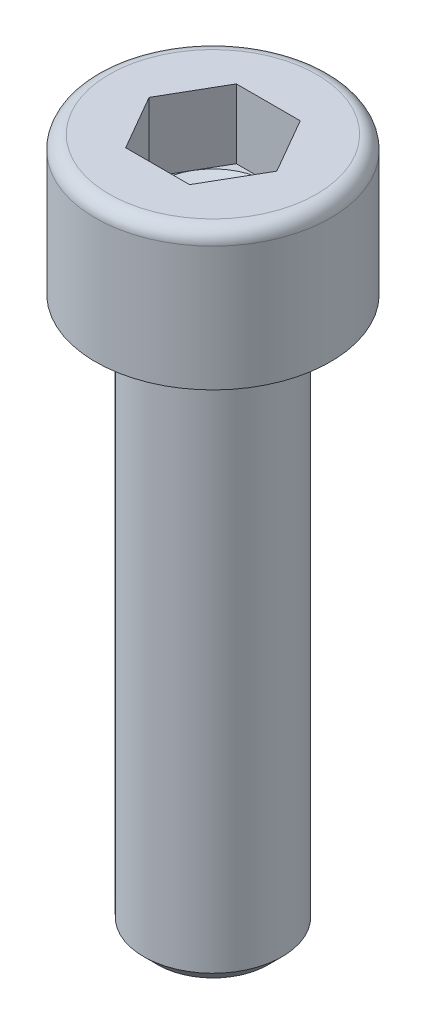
ISO-10303-21;
HEADER;
FILE_DESCRIPTION(('STEP AP214'),'2;1');
FILE_NAME('part.step','',(''),(''),'','','');
FILE_SCHEMA(('AUTOMOTIVE_DESIGN { 1 0 10303 214 1 1 1 1 }'));
ENDSEC;
DATA;
#1=APPLICATION_CONTEXT('core data for automotive mechanical design processes');
#2=APPLICATION_PROTOCOL_DEFINITION('international standard','automotive_design',2000,#1);
#3=PRODUCT_CONTEXT('',#1,'mechanical');
#4=PRODUCT('Part','Part','',(#3));
#5=PRODUCT_RELATED_PRODUCT_CATEGORY('part','',(#4));
#6=PRODUCT_DEFINITION_FORMATION('','',#4);
#7=PRODUCT_DEFINITION_CONTEXT('part definition',#1,'design');
#8=PRODUCT_DEFINITION('design','',#6,#7);
#9=PRODUCT_DEFINITION_SHAPE('','',#8);
#10=(LENGTH_UNIT() NAMED_UNIT(*) SI_UNIT(.MILLI.,.METRE.));
#11=(NAMED_UNIT(*) PLANE_ANGLE_UNIT() SI_UNIT($,.RADIAN.));
#12=(NAMED_UNIT(*) SI_UNIT($,.STERADIAN.) SOLID_ANGLE_UNIT());
#13=UNCERTAINTY_MEASURE_WITH_UNIT(LENGTH_MEASURE(1.E-05),#10,'distance_accuracy_value','');
#14=(GEOMETRIC_REPRESENTATION_CONTEXT(3) GLOBAL_UNCERTAINTY_ASSIGNED_CONTEXT((#13)) GLOBAL_UNIT_ASSIGNED_CONTEXT((#10,
#11,#12)) REPRESENTATION_CONTEXT('',''));
#15=CARTESIAN_POINT('',(0.,0.,0.));
#16=DIRECTION('',(0.,0.,1.));
#17=DIRECTION('',(1.,0.,0.));
#18=AXIS2_PLACEMENT_3D('',#15,#16,#17);
#19=CARTESIAN_POINT('',(0.,-2.50000000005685,3.99999999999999));
#20=DIRECTION('',(0.,-1.,0.));
#21=DIRECTION('',(1.,0.,0.));
#22=AXIS2_PLACEMENT_3D('',#19,#20,#21);
#23=PLANE('',#22);
#24=DIRECTION('',(0.500000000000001,0.,-0.866025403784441));
#25=VECTOR('',#24,1.);
#26=CARTESIAN_POINT('',(2.30940107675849,-2.50000000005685,0.));
#27=LINE('',#26,#25);
#28=CARTESIAN_POINT('',(1.15470053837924,-2.50000000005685,2.));
#29=VERTEX_POINT('',#28);
#30=CARTESIAN_POINT('',(1.73205080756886,-2.50000000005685,0.999999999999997));
#31=VERTEX_POINT('',#30);
#32=EDGE_CURVE('E133',#29,#31,#27,.T.);
#33=ORIENTED_EDGE('',*,*,#32,.T.);
#34=CARTESIAN_POINT('',(0.,-2.50000000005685,0.));
#35=DIRECTION('',(0.,-1.,0.));
#36=DIRECTION('',(1.,0.,0.));
#37=AXIS2_PLACEMENT_3D('',#34,#35,#36);
#38=CIRCLE('',#37,2.);
#39=CARTESIAN_POINT('',(0.,-2.50000000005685,2.));
#40=VERTEX_POINT('',#39);
#41=EDGE_CURVE('E11',#31,#40,#38,.T.);
#42=ORIENTED_EDGE('',*,*,#41,.T.);
#43=DIRECTION('',(1.,0.,0.));
#44=VECTOR('',#43,1.);
#45=CARTESIAN_POINT('',(1.15470053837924,-2.50000000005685,2.));
#46=LINE('',#45,#44);
#47=EDGE_CURVE('E130',#40,#29,#46,.T.);
#48=ORIENTED_EDGE('',*,*,#47,.T.);
#49=EDGE_LOOP('',(#33,#42,#48));
#50=FACE_BOUND('',#49,.T.);
#51=ADVANCED_FACE('F42',(#50),#23,.F.);
#52=CARTESIAN_POINT('',(-1.15470053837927,-2.50000000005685,2.));
#53=VERTEX_POINT('',#52);
#54=EDGE_CURVE('E138',#53,#40,#46,.T.);
#55=ORIENTED_EDGE('',*,*,#54,.T.);
#56=CARTESIAN_POINT('',(0.,-2.50000000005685,0.));
#57=DIRECTION('',(0.,1.,0.));
#58=DIRECTION('',(-1.,0.,0.));
#59=AXIS2_PLACEMENT_3D('',#56,#57,#58);
#60=CIRCLE('',#59,2.);
#61=CARTESIAN_POINT('',(-1.7320508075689,-2.50000000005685,0.999999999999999));
#62=VERTEX_POINT('',#61);
#63=EDGE_CURVE('E120',#62,#40,#60,.T.);
#64=ORIENTED_EDGE('',*,*,#63,.F.);
#65=DIRECTION('',(0.500000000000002,0.,0.86602540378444));
#66=VECTOR('',#65,1.);
#67=CARTESIAN_POINT('',(-1.15470053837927,-2.50000000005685,2.));
#68=LINE('',#67,#66);
#69=EDGE_CURVE('E144',#62,#53,#68,.T.);
#70=ORIENTED_EDGE('',*,*,#69,.T.);
#71=EDGE_LOOP('',(#55,#64,#70));
#72=FACE_BOUND('',#71,.T.);
#73=ADVANCED_FACE('F143',(#72),#23,.F.);
#74=CARTESIAN_POINT('',(-2.3094010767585,-2.50000000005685,0.));
#75=VERTEX_POINT('',#74);
#76=EDGE_CURVE('E141',#75,#62,#68,.T.);
#77=ORIENTED_EDGE('',*,*,#76,.T.);
#78=CARTESIAN_POINT('',(-1.73205080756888,-2.50000000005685,-1.00000000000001));
#79=VERTEX_POINT('',#78);
#80=EDGE_CURVE('E52',#62,#79,#38,.T.);
#81=ORIENTED_EDGE('',*,*,#80,.T.);
#82=DIRECTION('',(-0.500000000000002,0.,0.866025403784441));
#83=VECTOR('',#82,1.);
#84=CARTESIAN_POINT('',(-2.3094010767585,-2.50000000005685,0.));
#85=LINE('',#84,#83);
#86=EDGE_CURVE('E235',#79,#75,#85,.T.);
#87=ORIENTED_EDGE('',*,*,#86,.T.);
#88=EDGE_LOOP('',(#77,#81,#87));
#89=FACE_BOUND('',#88,.T.);
#90=ADVANCED_FACE('F234',(#89),#23,.F.);
#91=CARTESIAN_POINT('',(-1.15470053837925,-2.50000000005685,-2.00000000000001));
#92=VERTEX_POINT('',#91);
#93=EDGE_CURVE('E241',#92,#79,#85,.T.);
#94=ORIENTED_EDGE('',*,*,#93,.T.);
#95=CARTESIAN_POINT('',(0.,-2.50000000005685,-2.));
#96=VERTEX_POINT('',#95);
#97=EDGE_CURVE('E220',#79,#96,#38,.T.);
#98=ORIENTED_EDGE('',*,*,#97,.T.);
#99=DIRECTION('',(-1.,0.,0.));
#100=VECTOR('',#99,1.);
#101=CARTESIAN_POINT('',(-1.15470053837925,-2.50000000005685,-2.00000000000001));
#102=LINE('',#101,#100);
#103=EDGE_CURVE('E245',#96,#92,#102,.T.);
#104=ORIENTED_EDGE('',*,*,#103,.T.);
#105=EDGE_LOOP('',(#94,#98,#104));
#106=FACE_BOUND('',#105,.T.);
#107=ADVANCED_FACE('F244',(#106),#23,.F.);
#108=CARTESIAN_POINT('',(1.15470053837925,-2.50000000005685,-2.00000000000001));
#109=VERTEX_POINT('',#108);
#110=EDGE_CURVE('E243',#109,#96,#102,.T.);
#111=ORIENTED_EDGE('',*,*,#110,.T.);
#112=CARTESIAN_POINT('',(1.73205080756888,-2.50000000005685,-1.00000000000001));
#113=VERTEX_POINT('',#112);
#114=EDGE_CURVE('E215',#96,#113,#38,.T.);
#115=ORIENTED_EDGE('',*,*,#114,.T.);
#116=DIRECTION('',(-0.500000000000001,0.,-0.866025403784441));
#117=VECTOR('',#116,1.);
#118=CARTESIAN_POINT('',(1.15470053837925,-2.50000000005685,-2.00000000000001));
#119=LINE('',#118,#117);
#120=EDGE_CURVE('E254',#113,#109,#119,.T.);
#121=ORIENTED_EDGE('',*,*,#120,.T.);
#122=EDGE_LOOP('',(#111,#115,#121));
#123=FACE_BOUND('',#122,.T.);
#124=ADVANCED_FACE('F265',(#123),#23,.F.);
#125=CARTESIAN_POINT('',(2.,-25.,0.));
#126=DIRECTION('',(0.,-1.,0.));
#127=DIRECTION('',(1.,0.,0.));
#128=AXIS2_PLACEMENT_3D('',#125,#126,#127);
#129=PLANE('',#128);
#130=CARTESIAN_POINT('',(0.,-25.,0.));
#131=DIRECTION('',(0.,1.,0.));
#132=DIRECTION('',(-1.,0.,0.));
#133=AXIS2_PLACEMENT_3D('',#130,#131,#132);
#134=CIRCLE('',#133,2.);
#135=CARTESIAN_POINT('',(-2.00000000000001,-25.,0.));
#136=VERTEX_POINT('',#135);
#137=EDGE_CURVE('E209',#136,#136,#134,.T.);
#138=ORIENTED_EDGE('',*,*,#137,.F.);
#139=EDGE_LOOP('',(#138));
#140=FACE_BOUND('',#139,.T.);
#141=ADVANCED_FACE('F44',(#140),#129,.T.);
#142=CARTESIAN_POINT('',(0.,-25.,0.));
#143=DIRECTION('',(0.,1.,0.));
#144=DIRECTION('',(-1.,0.,0.));
#145=AXIS2_PLACEMENT_3D('',#142,#143,#144);
#146=CONICAL_SURFACE('',#145,2.,0.785398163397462);
#147=CARTESIAN_POINT('',(0.,-24.5,0.));
#148=DIRECTION('',(0.,1.,0.));
#149=DIRECTION('',(-1.,0.,0.));
#150=AXIS2_PLACEMENT_3D('',#147,#148,#149);
#151=CIRCLE('',#150,2.5);
#152=CARTESIAN_POINT('',(-2.50000000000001,-24.5,0.));
#153=VERTEX_POINT('',#152);
#154=EDGE_CURVE('E206',#153,#153,#151,.T.);
#155=ORIENTED_EDGE('',*,*,#154,.F.);
#156=EDGE_LOOP('',(#155));
#157=FACE_BOUND('',#156,.T.);
#158=ORIENTED_EDGE('',*,*,#137,.T.);
#159=EDGE_LOOP('',(#158));
#160=FACE_BOUND('',#159,.T.);
#161=ADVANCED_FACE('F302',(#157,#160),#146,.T.);
#162=CARTESIAN_POINT('',(0.,65.1172922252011,0.));
#163=DIRECTION('',(0.,1.,0.));
#164=DIRECTION('',(-1.,0.,0.));
#165=AXIS2_PLACEMENT_3D('',#162,#163,#164);
#166=CYLINDRICAL_SURFACE('',#165,2.5);
#167=ORIENTED_EDGE('',*,*,#154,.T.);
#168=EDGE_LOOP('',(#167));
#169=FACE_BOUND('',#168,.T.);
#170=CARTESIAN_POINT('',(0.,-5.,0.));
#171=DIRECTION('',(0.,1.,0.));
#172=DIRECTION('',(-1.,0.,0.));
#173=AXIS2_PLACEMENT_3D('',#170,#171,#172);
#174=CIRCLE('',#173,2.5);
#175=CARTESIAN_POINT('',(-2.5,-5.,0.));
#176=VERTEX_POINT('',#175);
#177=EDGE_CURVE('E202',#176,#176,#174,.T.);
#178=ORIENTED_EDGE('',*,*,#177,.F.);
#179=EDGE_LOOP('',(#178));
#180=FACE_BOUND('',#179,.T.);
#181=ADVANCED_FACE('F410',(#169,#180),#166,.T.);
#182=CARTESIAN_POINT('',(2.50000000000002,-5.,0.));
#183=DIRECTION('',(0.,1.,0.));
#184=DIRECTION('',(-1.,0.,0.));
#185=AXIS2_PLACEMENT_3D('',#182,#183,#184);
#186=PLANE('',#185);
#187=CARTESIAN_POINT('',(0.,-5.,0.));
#188=DIRECTION('',(0.,1.,0.));
#189=DIRECTION('',(-1.,0.,0.));
#190=AXIS2_PLACEMENT_3D('',#187,#188,#189);
#191=CIRCLE('',#190,4.25);
#192=CARTESIAN_POINT('',(-4.25,-5.00000000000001,0.));
#193=VERTEX_POINT('',#192);
#194=EDGE_CURVE('E198',#193,#193,#191,.T.);
#195=ORIENTED_EDGE('',*,*,#194,.F.);
#196=EDGE_LOOP('',(#195));
#197=FACE_BOUND('',#196,.T.);
#198=ORIENTED_EDGE('',*,*,#177,.T.);
#199=EDGE_LOOP('',(#198));
#200=FACE_BOUND('',#199,.T.);
#201=ADVANCED_FACE('F399',(#197,#200),#186,.F.);
#202=CARTESIAN_POINT('',(0.,65.1172922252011,0.));
#203=DIRECTION('',(0.,1.,0.));
#204=DIRECTION('',(-1.,0.,0.));
#205=AXIS2_PLACEMENT_3D('',#202,#203,#204);
#206=CYLINDRICAL_SURFACE('',#205,4.25);
#207=CARTESIAN_POINT('',(0.,-0.5,0.));
#208=DIRECTION('',(0.,1.,0.));
#209=DIRECTION('',(-1.,0.,0.));
#210=AXIS2_PLACEMENT_3D('',#207,#208,#209);
#211=CIRCLE('',#210,4.25);
#212=CARTESIAN_POINT('',(-4.25,-0.500000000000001,0.));
#213=VERTEX_POINT('',#212);
#214=EDGE_CURVE('E195',#213,#213,#211,.T.);
#215=ORIENTED_EDGE('',*,*,#214,.F.);
#216=EDGE_LOOP('',(#215));
#217=FACE_BOUND('',#216,.T.);
#218=ORIENTED_EDGE('',*,*,#194,.T.);
#219=EDGE_LOOP('',(#218));
#220=FACE_BOUND('',#219,.T.);
#221=ADVANCED_FACE('F389',(#217,#220),#206,.T.);
#222=CARTESIAN_POINT('',(0.,-0.5,0.));
#223=DIRECTION('',(0.,1.,0.));
#224=DIRECTION('',(-1.,0.,0.));
#225=AXIS2_PLACEMENT_3D('',#222,#223,#224);
#226=TOROIDAL_SURFACE('',#225,3.75,0.5);
#227=CARTESIAN_POINT('',(0.,0.,0.));
#228=DIRECTION('',(0.,1.,0.));
#229=DIRECTION('',(-1.,0.,0.));
#230=AXIS2_PLACEMENT_3D('',#227,#228,#229);
#231=CIRCLE('',#230,3.75);
#232=CARTESIAN_POINT('',(-3.75,0.,0.));
#233=VERTEX_POINT('',#232);
#234=EDGE_CURVE('E180',#233,#233,#231,.T.);
#235=ORIENTED_EDGE('',*,*,#234,.F.);
#236=EDGE_LOOP('',(#235));
#237=FACE_BOUND('',#236,.T.);
#238=ORIENTED_EDGE('',*,*,#214,.T.);
#239=EDGE_LOOP('',(#238));
#240=FACE_BOUND('',#239,.T.);
#241=ADVANCED_FACE('F380',(#237,#240),#226,.T.);
#242=CARTESIAN_POINT('',(3.75000000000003,0.,0.));
#243=DIRECTION('',(0.,-1.,0.));
#244=DIRECTION('',(1.,0.,0.));
#245=AXIS2_PLACEMENT_3D('',#242,#243,#244);
#246=PLANE('',#245);
#247=DIRECTION('',(-0.500000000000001,0.,-0.866025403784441));
#248=VECTOR('',#247,1.);
#249=CARTESIAN_POINT('',(1.15470053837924,-5.6843418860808E-11,-2.));
#250=LINE('',#249,#248);
#251=CARTESIAN_POINT('',(2.30940107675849,0.,0.));
#252=VERTEX_POINT('',#251);
#253=CARTESIAN_POINT('',(1.15470053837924,-5.6843418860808E-11,-2.));
#254=VERTEX_POINT('',#253);
#255=EDGE_CURVE('E158',#252,#254,#250,.T.);
#256=ORIENTED_EDGE('',*,*,#255,.F.);
#257=DIRECTION('',(0.500000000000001,0.,-0.866025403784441));
#258=VECTOR('',#257,1.);
#259=CARTESIAN_POINT('',(2.30940107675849,-5.6843418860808E-11,0.));
#260=LINE('',#259,#258);
#261=CARTESIAN_POINT('',(1.15470053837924,-5.6843418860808E-11,2.));
#262=VERTEX_POINT('',#261);
#263=EDGE_CURVE('E65',#262,#252,#260,.T.);
#264=ORIENTED_EDGE('',*,*,#263,.F.);
#265=DIRECTION('',(1.,0.,0.));
#266=VECTOR('',#265,1.);
#267=CARTESIAN_POINT('',(1.15470053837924,-5.6843418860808E-11,2.));
#268=LINE('',#267,#266);
#269=CARTESIAN_POINT('',(-1.15470053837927,-5.6843418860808E-11,2.));
#270=VERTEX_POINT('',#269);
#271=EDGE_CURVE('E174',#270,#262,#268,.T.);
#272=ORIENTED_EDGE('',*,*,#271,.F.);
#273=DIRECTION('',(0.500000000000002,0.,0.86602540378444));
#274=VECTOR('',#273,1.);
#275=CARTESIAN_POINT('',(-1.15470053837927,-5.6843418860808E-11,2.));
#276=LINE('',#275,#274);
#277=CARTESIAN_POINT('',(-2.3094010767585,-5.6843418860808E-11,0.));
#278=VERTEX_POINT('',#277);
#279=EDGE_CURVE('E170',#278,#270,#276,.T.);
#280=ORIENTED_EDGE('',*,*,#279,.F.);
#281=DIRECTION('',(-0.500000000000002,0.,0.866025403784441));
#282=VECTOR('',#281,1.);
#283=CARTESIAN_POINT('',(-2.3094010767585,-5.6843418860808E-11,0.));
#284=LINE('',#283,#282);
#285=CARTESIAN_POINT('',(-1.15470053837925,-5.6843418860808E-11,-2.00000000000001));
#286=VERTEX_POINT('',#285);
#287=EDGE_CURVE('E166',#286,#278,#284,.T.);
#288=ORIENTED_EDGE('',*,*,#287,.F.);
#289=DIRECTION('',(-1.,0.,0.));
#290=VECTOR('',#289,1.);
#291=CARTESIAN_POINT('',(-1.15470053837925,-5.6843418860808E-11,-2.00000000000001));
#292=LINE('',#291,#290);
#293=EDGE_CURVE('E162',#254,#286,#292,.T.);
#294=ORIENTED_EDGE('',*,*,#293,.F.);
#295=EDGE_LOOP('',(#256,#264,#272,#280,#288,#294));
#296=FACE_BOUND('',#295,.T.);
#297=ORIENTED_EDGE('',*,*,#234,.T.);
#298=EDGE_LOOP('',(#297));
#299=FACE_BOUND('',#298,.T.);
#300=ADVANCED_FACE('F274',(#296,#299),#246,.F.);
#301=CARTESIAN_POINT('',(2.30940107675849,-2.50000000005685,0.));
#302=DIRECTION('',(0.866025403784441,0.,0.500000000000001));
#303=DIRECTION('',(0.500000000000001,0.,-0.866025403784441));
#304=AXIS2_PLACEMENT_3D('',#301,#302,#303);
#305=PLANE('',#304);
#306=ORIENTED_EDGE('',*,*,#263,.T.);
#307=DIRECTION('',(0.,1.,0.));
#308=VECTOR('',#307,1.);
#309=CARTESIAN_POINT('',(2.30940107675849,-2.50000000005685,0.));
#310=LINE('',#309,#308);
#311=CARTESIAN_POINT('',(2.30940107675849,-2.50000000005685,0.));
#312=VERTEX_POINT('',#311);
#313=EDGE_CURVE('E147',#312,#252,#310,.T.);
#314=ORIENTED_EDGE('',*,*,#313,.F.);
#315=EDGE_CURVE('E177',#31,#312,#27,.T.);
#316=ORIENTED_EDGE('',*,*,#315,.F.);
#317=ORIENTED_EDGE('',*,*,#32,.F.);
#318=DIRECTION('',(0.,1.,0.));
#319=VECTOR('',#318,1.);
#320=CARTESIAN_POINT('',(1.15470053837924,-2.50000000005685,2.));
#321=LINE('',#320,#319);
#322=EDGE_CURVE('E139',#29,#262,#321,.T.);
#323=ORIENTED_EDGE('',*,*,#322,.T.);
#324=EDGE_LOOP('',(#306,#314,#316,#317,#323));
#325=FACE_BOUND('',#324,.T.);
#326=ADVANCED_FACE('F259',(#325),#305,.F.);
#327=CARTESIAN_POINT('',(1.15470053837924,-2.50000000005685,2.));
#328=DIRECTION('',(0.,0.,1.));
#329=DIRECTION('',(1.,0.,0.));
#330=AXIS2_PLACEMENT_3D('',#327,#328,#329);
#331=PLANE('',#330);
#332=ORIENTED_EDGE('',*,*,#271,.T.);
#333=ORIENTED_EDGE('',*,*,#322,.F.);
#334=ORIENTED_EDGE('',*,*,#47,.F.);
#335=ORIENTED_EDGE('',*,*,#54,.F.);
#336=DIRECTION('',(0.,1.,0.));
#337=VECTOR('',#336,1.);
#338=CARTESIAN_POINT('',(-1.15470053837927,-2.50000000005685,2.));
#339=LINE('',#338,#337);
#340=EDGE_CURVE('E181',#53,#270,#339,.T.);
#341=ORIENTED_EDGE('',*,*,#340,.T.);
#342=EDGE_LOOP('',(#332,#333,#334,#335,#341));
#343=FACE_BOUND('',#342,.T.);
#344=ADVANCED_FACE('F137',(#343),#331,.F.);
#345=CARTESIAN_POINT('',(-1.15470053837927,-2.50000000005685,2.));
#346=DIRECTION('',(-0.86602540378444,0.,0.500000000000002));
#347=DIRECTION('',(0.500000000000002,0.,0.866025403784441));
#348=AXIS2_PLACEMENT_3D('',#345,#346,#347);
#349=PLANE('',#348);
#350=ORIENTED_EDGE('',*,*,#279,.T.);
#351=ORIENTED_EDGE('',*,*,#340,.F.);
#352=ORIENTED_EDGE('',*,*,#69,.F.);
#353=ORIENTED_EDGE('',*,*,#76,.F.);
#354=DIRECTION('',(0.,1.,0.));
#355=VECTOR('',#354,1.);
#356=CARTESIAN_POINT('',(-2.3094010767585,-2.50000000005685,0.));
#357=LINE('',#356,#355);
#358=EDGE_CURVE('E184',#75,#278,#357,.T.);
#359=ORIENTED_EDGE('',*,*,#358,.T.);
#360=EDGE_LOOP('',(#350,#351,#352,#353,#359));
#361=FACE_BOUND('',#360,.T.);
#362=ADVANCED_FACE('F277',(#361),#349,.F.);
#363=CARTESIAN_POINT('',(-2.3094010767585,-2.50000000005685,0.));
#364=DIRECTION('',(-0.866025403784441,0.,-0.500000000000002));
#365=DIRECTION('',(-0.500000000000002,0.,0.866025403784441));
#366=AXIS2_PLACEMENT_3D('',#363,#364,#365);
#367=PLANE('',#366);
#368=ORIENTED_EDGE('',*,*,#287,.T.);
#369=ORIENTED_EDGE('',*,*,#358,.F.);
#370=ORIENTED_EDGE('',*,*,#86,.F.);
#371=ORIENTED_EDGE('',*,*,#93,.F.);
#372=DIRECTION('',(0.,1.,0.));
#373=VECTOR('',#372,1.);
#374=CARTESIAN_POINT('',(-1.15470053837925,-2.50000000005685,-2.00000000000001));
#375=LINE('',#374,#373);
#376=EDGE_CURVE('E187',#92,#286,#375,.T.);
#377=ORIENTED_EDGE('',*,*,#376,.T.);
#378=EDGE_LOOP('',(#368,#369,#370,#371,#377));
#379=FACE_BOUND('',#378,.T.);
#380=ADVANCED_FACE('F240',(#379),#367,.F.);
#381=CARTESIAN_POINT('',(-1.15470053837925,-2.50000000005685,-2.00000000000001));
#382=DIRECTION('',(0.,0.,-1.));
#383=DIRECTION('',(-1.,0.,0.));
#384=AXIS2_PLACEMENT_3D('',#381,#382,#383);
#385=PLANE('',#384);
#386=ORIENTED_EDGE('',*,*,#293,.T.);
#387=ORIENTED_EDGE('',*,*,#376,.F.);
#388=ORIENTED_EDGE('',*,*,#103,.F.);
#389=ORIENTED_EDGE('',*,*,#110,.F.);
#390=DIRECTION('',(0.,1.,0.));
#391=VECTOR('',#390,1.);
#392=CARTESIAN_POINT('',(1.15470053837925,-2.50000000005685,-2.00000000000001));
#393=LINE('',#392,#391);
#394=EDGE_CURVE('E151',#109,#254,#393,.T.);
#395=ORIENTED_EDGE('',*,*,#394,.T.);
#396=EDGE_LOOP('',(#386,#387,#388,#389,#395));
#397=FACE_BOUND('',#396,.T.);
#398=ADVANCED_FACE('F267',(#397),#385,.F.);
#399=CARTESIAN_POINT('',(1.15470053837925,-2.50000000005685,-2.00000000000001));
#400=DIRECTION('',(0.866025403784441,0.,-0.500000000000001));
#401=DIRECTION('',(-0.5,0.,-0.866025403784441));
#402=AXIS2_PLACEMENT_3D('',#399,#400,#401);
#403=PLANE('',#402);
#404=ORIENTED_EDGE('',*,*,#255,.T.);
#405=ORIENTED_EDGE('',*,*,#394,.F.);
#406=ORIENTED_EDGE('',*,*,#120,.F.);
#407=EDGE_CURVE('E251',#312,#113,#119,.T.);
#408=ORIENTED_EDGE('',*,*,#407,.F.);
#409=ORIENTED_EDGE('',*,*,#313,.T.);
#410=EDGE_LOOP('',(#404,#405,#406,#408,#409));
#411=FACE_BOUND('',#410,.T.);
#412=ADVANCED_FACE('F262',(#411),#403,.F.);
#413=ORIENTED_EDGE('',*,*,#407,.T.);
#414=EDGE_CURVE('E46',#113,#31,#38,.T.);
#415=ORIENTED_EDGE('',*,*,#414,.T.);
#416=ORIENTED_EDGE('',*,*,#315,.T.);
#417=EDGE_LOOP('',(#413,#415,#416));
#418=FACE_BOUND('',#417,.T.);
#419=ADVANCED_FACE('F117',(#418),#23,.F.);
#420=CARTESIAN_POINT('',(0.,-2.50000000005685,0.));
#421=DIRECTION('',(0.,1.,0.));
#422=DIRECTION('',(-1.,0.,0.));
#423=AXIS2_PLACEMENT_3D('',#420,#421,#422);
#424=CONICAL_SURFACE('',#423,2.,1.22173047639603);
#425=CARTESIAN_POINT('',(0.,-3.22794046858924,0.));
#426=VERTEX_POINT('',#425);
#427=VERTEX_LOOP('',#426);
#428=FACE_BOUND('',#427,.T.);
#429=ORIENTED_EDGE('',*,*,#63,.T.);
#430=ORIENTED_EDGE('',*,*,#41,.F.);
#431=ORIENTED_EDGE('',*,*,#414,.F.);
#432=ORIENTED_EDGE('',*,*,#114,.F.);
#433=ORIENTED_EDGE('',*,*,#97,.F.);
#434=ORIENTED_EDGE('',*,*,#80,.F.);
#435=EDGE_LOOP('',(#429,#430,#431,#432,#433,#434));
#436=FACE_BOUND('',#435,.T.);
#437=ADVANCED_FACE('F115',(#428,#436),#424,.F.);
#438=CLOSED_SHELL('',(#51,#73,#90,#107,#124,#141,#161,#181,#201,#221,#241,#300,#326,#344,#362,
#380,#398,#412,#419,#437));
#439=MANIFOLD_SOLID_BREP('B2',#438);
#440=ADVANCED_BREP_SHAPE_REPRESENTATION('',(#18,#439),#14);
#441=SHAPE_DEFINITION_REPRESENTATION(#9,#440);
ENDSEC;
END-ISO-10303-21;
